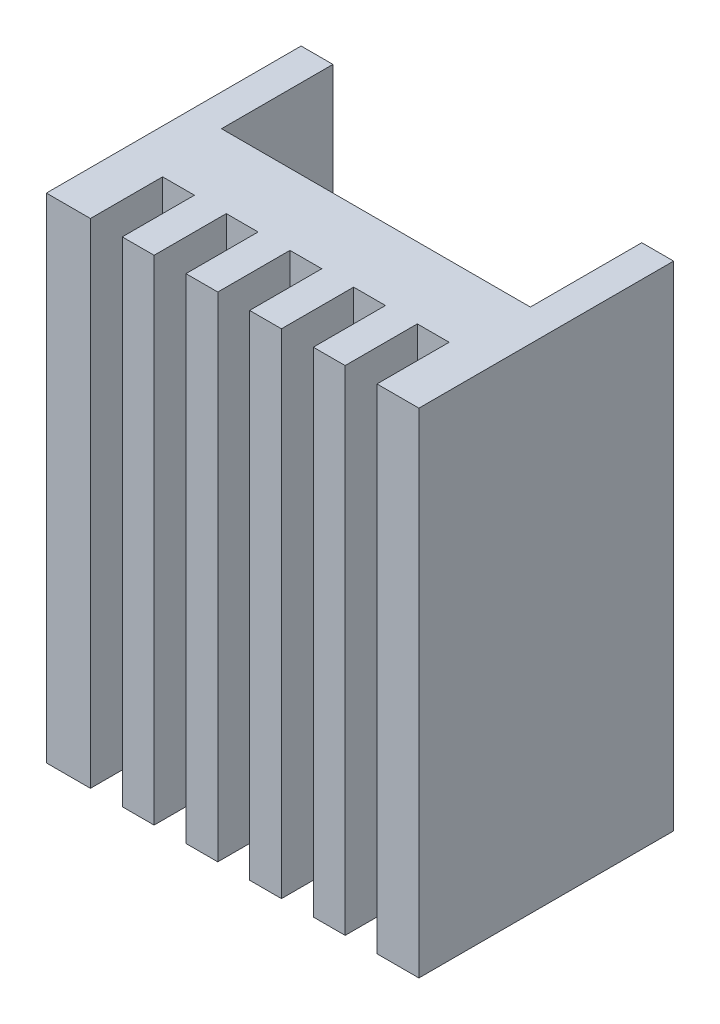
from build123d import *

# Parameters (mm, degrees)
BOSS_EXTRUDE1_DEPTH = 31
SKETCH2_W           = 2
SKETCH2_H           = 4.533544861
CUT_EXTRUDE1_DEPTH  = 43.006666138


with BuildPart() as part:
    # Sketch1 → Boss-Extrude1 (new body)
    with BuildSketch(Plane(origin=(0, 0, 0), x_dir=(1, 0, 0), z_dir=(0, 1, 0))):
        Polygon((21.4, 16), (23.4, 16), (23.4, 0), (0, 0), (0, 16), (2, 16), (2, 9), (21.4, 9), align=None)
    extrude(amount=BOSS_EXTRUDE1_DEPTH)

    # Sketch2 → Cut-Extrude1 (cut, through all)
    with BuildSketch(Plane(origin=(0, 31, 0), x_dir=(1, 0, 0), z_dir=(0, 1, 0))):
        with Locations((3.766668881, 2.266772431)):
            Rectangle(SKETCH2_W, SKETCH2_H)
        with Locations((7.766668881, 2.266772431)):
            Rectangle(SKETCH2_W, SKETCH2_H)
        with Locations((11.766668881, 2.266772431)):
            Rectangle(SKETCH2_W, SKETCH2_H)
        with Locations((15.766668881, 2.266772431)):
            Rectangle(SKETCH2_W, SKETCH2_H)
        with Locations((19.766668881, 2.266772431)):
            Rectangle(SKETCH2_W, SKETCH2_H)
    extrude(amount=-CUT_EXTRUDE1_DEPTH, mode=Mode.SUBTRACT)


solid = part.part
